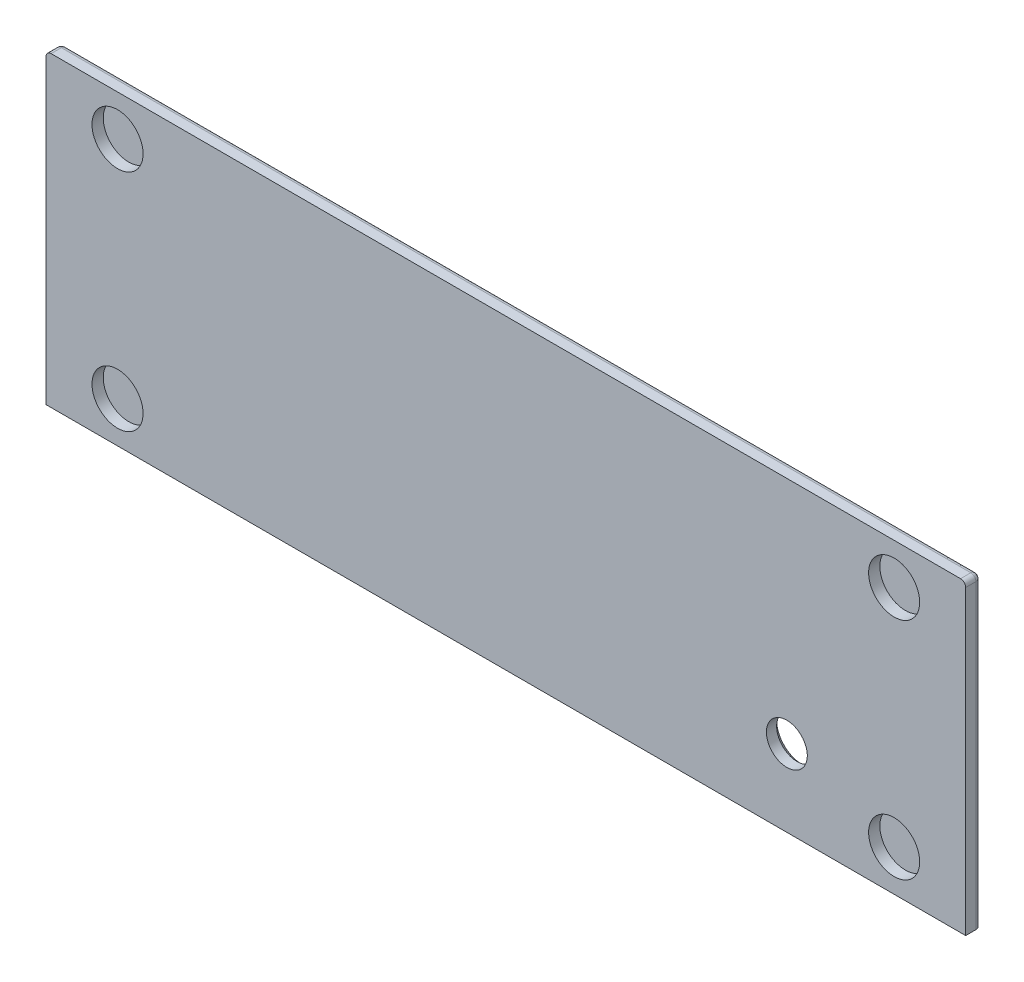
ISO-10303-21;
HEADER;
FILE_DESCRIPTION(('STEP AP214'),'2;1');
FILE_NAME('part.step','',(''),(''),'','','');
FILE_SCHEMA(('AUTOMOTIVE_DESIGN { 1 0 10303 214 1 1 1 1 }'));
ENDSEC;
DATA;
#1=APPLICATION_CONTEXT('core data for automotive mechanical design processes');
#2=APPLICATION_PROTOCOL_DEFINITION('international standard','automotive_design',2000,#1);
#3=PRODUCT_CONTEXT('',#1,'mechanical');
#4=PRODUCT('Part','Part','',(#3));
#5=PRODUCT_RELATED_PRODUCT_CATEGORY('part','',(#4));
#6=PRODUCT_DEFINITION_FORMATION('','',#4);
#7=PRODUCT_DEFINITION_CONTEXT('part definition',#1,'design');
#8=PRODUCT_DEFINITION('design','',#6,#7);
#9=PRODUCT_DEFINITION_SHAPE('','',#8);
#10=(LENGTH_UNIT() NAMED_UNIT(*) SI_UNIT(.MILLI.,.METRE.));
#11=(NAMED_UNIT(*) PLANE_ANGLE_UNIT() SI_UNIT($,.RADIAN.));
#12=(NAMED_UNIT(*) SI_UNIT($,.STERADIAN.) SOLID_ANGLE_UNIT());
#13=UNCERTAINTY_MEASURE_WITH_UNIT(LENGTH_MEASURE(1.E-05),#10,'distance_accuracy_value','');
#14=(GEOMETRIC_REPRESENTATION_CONTEXT(3) GLOBAL_UNCERTAINTY_ASSIGNED_CONTEXT((#13)) GLOBAL_UNIT_ASSIGNED_CONTEXT((#10,
#11,#12)) REPRESENTATION_CONTEXT('',''));
#15=CARTESIAN_POINT('',(0.,0.,0.));
#16=DIRECTION('',(0.,0.,1.));
#17=DIRECTION('',(1.,0.,0.));
#18=AXIS2_PLACEMENT_3D('',#15,#16,#17);
#19=CARTESIAN_POINT('',(90.,-30.,3.));
#20=DIRECTION('',(-1.,0.,0.));
#21=DIRECTION('',(0.,0.,1.));
#22=AXIS2_PLACEMENT_3D('',#19,#20,#21);
#23=PLANE('',#22);
#24=DIRECTION('',(0.,0.,-1.));
#25=VECTOR('',#24,1.);
#26=CARTESIAN_POINT('',(90.,-30.,3.));
#27=LINE('',#26,#25);
#28=CARTESIAN_POINT('',(90.,-30.,3.));
#29=VERTEX_POINT('',#28);
#30=CARTESIAN_POINT('',(90.,-30.,1.));
#31=VERTEX_POINT('',#30);
#32=EDGE_CURVE('E138',#29,#31,#27,.T.);
#33=ORIENTED_EDGE('',*,*,#32,.T.);
#34=DIRECTION('',(0.,1.,0.));
#35=VECTOR('',#34,1.);
#36=CARTESIAN_POINT('',(90.,30.,1.));
#37=LINE('',#36,#35);
#38=CARTESIAN_POINT('',(90.,29.,1.));
#39=VERTEX_POINT('',#38);
#40=EDGE_CURVE('E64',#31,#39,#37,.T.);
#41=ORIENTED_EDGE('',*,*,#40,.T.);
#42=DIRECTION('',(0.,0.,-1.));
#43=VECTOR('',#42,1.);
#44=CARTESIAN_POINT('',(90.,29.,3.));
#45=LINE('',#44,#43);
#46=CARTESIAN_POINT('',(90.,29.,3.));
#47=VERTEX_POINT('',#46);
#48=EDGE_CURVE('E187',#39,#47,#45,.F.);
#49=ORIENTED_EDGE('',*,*,#48,.T.);
#50=DIRECTION('',(0.,1.,0.));
#51=VECTOR('',#50,1.);
#52=CARTESIAN_POINT('',(90.,-30.,3.));
#53=LINE('',#52,#51);
#54=EDGE_CURVE('E151',#29,#47,#53,.T.);
#55=ORIENTED_EDGE('',*,*,#54,.F.);
#56=EDGE_LOOP('',(#33,#41,#49,#55));
#57=FACE_BOUND('',#56,.T.);
#58=ADVANCED_FACE('F47',(#57),#23,.F.);
#59=CARTESIAN_POINT('',(-90.,30.,3.));
#60=DIRECTION('',(0.,-1.,0.));
#61=DIRECTION('',(0.,0.,-1.));
#62=AXIS2_PLACEMENT_3D('',#59,#60,#61);
#63=PLANE('',#62);
#64=DIRECTION('',(-1.,0.,0.));
#65=VECTOR('',#64,1.);
#66=CARTESIAN_POINT('',(-90.,30.,1.));
#67=LINE('',#66,#65);
#68=CARTESIAN_POINT('',(89.,30.,1.));
#69=VERTEX_POINT('',#68);
#70=CARTESIAN_POINT('',(-89.,30.,1.));
#71=VERTEX_POINT('',#70);
#72=EDGE_CURVE('E162',#69,#71,#67,.T.);
#73=ORIENTED_EDGE('',*,*,#72,.T.);
#74=DIRECTION('',(0.,0.,-1.));
#75=VECTOR('',#74,1.);
#76=CARTESIAN_POINT('',(-89.,30.,3.));
#77=LINE('',#76,#75);
#78=CARTESIAN_POINT('',(-89.,30.,3.));
#79=VERTEX_POINT('',#78);
#80=EDGE_CURVE('E165',#71,#79,#77,.F.);
#81=ORIENTED_EDGE('',*,*,#80,.T.);
#82=DIRECTION('',(-1.,0.,0.));
#83=VECTOR('',#82,1.);
#84=CARTESIAN_POINT('',(-90.,30.,3.));
#85=LINE('',#84,#83);
#86=CARTESIAN_POINT('',(88.9999999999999,30.,3.));
#87=VERTEX_POINT('',#86);
#88=EDGE_CURVE('E128',#87,#79,#85,.T.);
#89=ORIENTED_EDGE('',*,*,#88,.F.);
#90=DIRECTION('',(0.,0.,-1.));
#91=VECTOR('',#90,1.);
#92=CARTESIAN_POINT('',(89.,30.,3.));
#93=LINE('',#92,#91);
#94=EDGE_CURVE('E159',#87,#69,#93,.T.);
#95=ORIENTED_EDGE('',*,*,#94,.T.);
#96=EDGE_LOOP('',(#73,#81,#89,#95));
#97=FACE_BOUND('',#96,.T.);
#98=ADVANCED_FACE('F232',(#97),#63,.F.);
#99=CARTESIAN_POINT('',(-90.,-30.,3.));
#100=DIRECTION('',(1.,0.,0.));
#101=DIRECTION('',(0.,0.,-1.));
#102=AXIS2_PLACEMENT_3D('',#99,#100,#101);
#103=PLANE('',#102);
#104=DIRECTION('',(0.,-1.,0.));
#105=VECTOR('',#104,1.);
#106=CARTESIAN_POINT('',(-90.,-30.,3.));
#107=LINE('',#106,#105);
#108=CARTESIAN_POINT('',(-90.,29.,3.));
#109=VERTEX_POINT('',#108);
#110=CARTESIAN_POINT('',(-90.,-30.,3.));
#111=VERTEX_POINT('',#110);
#112=EDGE_CURVE('E114',#109,#111,#107,.T.);
#113=ORIENTED_EDGE('',*,*,#112,.F.);
#114=DIRECTION('',(0.,0.,-1.));
#115=VECTOR('',#114,1.);
#116=CARTESIAN_POINT('',(-90.,29.,3.));
#117=LINE('',#116,#115);
#118=CARTESIAN_POINT('',(-90.,29.,1.));
#119=VERTEX_POINT('',#118);
#120=EDGE_CURVE('E156',#109,#119,#117,.T.);
#121=ORIENTED_EDGE('',*,*,#120,.T.);
#122=DIRECTION('',(0.,-1.,0.));
#123=VECTOR('',#122,1.);
#124=CARTESIAN_POINT('',(-90.,-30.,1.));
#125=LINE('',#124,#123);
#126=CARTESIAN_POINT('',(-90.,-30.,1.));
#127=VERTEX_POINT('',#126);
#128=EDGE_CURVE('E134',#119,#127,#125,.T.);
#129=ORIENTED_EDGE('',*,*,#128,.T.);
#130=DIRECTION('',(0.,0.,-1.));
#131=VECTOR('',#130,1.);
#132=CARTESIAN_POINT('',(-90.,-30.,3.));
#133=LINE('',#132,#131);
#134=EDGE_CURVE('E131',#111,#127,#133,.T.);
#135=ORIENTED_EDGE('',*,*,#134,.F.);
#136=EDGE_LOOP('',(#113,#121,#129,#135));
#137=FACE_BOUND('',#136,.T.);
#138=ADVANCED_FACE('F132',(#137),#103,.F.);
#139=CARTESIAN_POINT('',(-90.,-30.,3.));
#140=DIRECTION('',(0.,1.,0.));
#141=DIRECTION('',(0.,0.,1.));
#142=AXIS2_PLACEMENT_3D('',#139,#140,#141);
#143=PLANE('',#142);
#144=ORIENTED_EDGE('',*,*,#134,.T.);
#145=CARTESIAN_POINT('',(-89.,-30.,1.));
#146=DIRECTION('',(0.,1.,0.));
#147=DIRECTION('',(0.,0.,1.));
#148=AXIS2_PLACEMENT_3D('',#145,#146,#147);
#149=CIRCLE('',#148,1.);
#150=CARTESIAN_POINT('',(-89.,-30.,0.));
#151=VERTEX_POINT('',#150);
#152=EDGE_CURVE('E176',#127,#151,#149,.F.);
#153=ORIENTED_EDGE('',*,*,#152,.T.);
#154=DIRECTION('',(1.,0.,0.));
#155=VECTOR('',#154,1.);
#156=CARTESIAN_POINT('',(-90.,-30.,0.));
#157=LINE('',#156,#155);
#158=CARTESIAN_POINT('',(88.9999999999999,-30.,0.));
#159=VERTEX_POINT('',#158);
#160=EDGE_CURVE('E148',#151,#159,#157,.T.);
#161=ORIENTED_EDGE('',*,*,#160,.T.);
#162=CARTESIAN_POINT('',(89.,-30.,1.));
#163=DIRECTION('',(0.,1.,0.));
#164=DIRECTION('',(0.,0.,1.));
#165=AXIS2_PLACEMENT_3D('',#162,#163,#164);
#166=CIRCLE('',#165,1.);
#167=EDGE_CURVE('E173',#159,#31,#166,.F.);
#168=ORIENTED_EDGE('',*,*,#167,.T.);
#169=ORIENTED_EDGE('',*,*,#32,.F.);
#170=DIRECTION('',(1.,0.,0.));
#171=VECTOR('',#170,1.);
#172=CARTESIAN_POINT('',(-90.,-30.,3.));
#173=LINE('',#172,#171);
#174=EDGE_CURVE('E120',#111,#29,#173,.T.);
#175=ORIENTED_EDGE('',*,*,#174,.F.);
#176=EDGE_LOOP('',(#144,#153,#161,#168,#169,#175));
#177=FACE_BOUND('',#176,.T.);
#178=ADVANCED_FACE('F140',(#177),#143,.F.);
#179=CARTESIAN_POINT('',(0.,0.,3.));
#180=DIRECTION('',(0.,0.,-1.));
#181=DIRECTION('',(-1.,0.,0.));
#182=AXIS2_PLACEMENT_3D('',#179,#180,#181);
#183=PLANE('',#182);
#184=CARTESIAN_POINT('',(55.,-15.,3.));
#185=DIRECTION('',(0.,0.,-1.));
#186=DIRECTION('',(-1.,0.,0.));
#187=AXIS2_PLACEMENT_3D('',#184,#185,#186);
#188=CIRCLE('',#187,4.00000000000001);
#189=CARTESIAN_POINT('',(51.,-15.,3.));
#190=VERTEX_POINT('',#189);
#191=EDGE_CURVE('E196',#190,#190,#188,.T.);
#192=ORIENTED_EDGE('',*,*,#191,.T.);
#193=EDGE_LOOP('',(#192));
#194=FACE_BOUND('',#193,.T.);
#195=CARTESIAN_POINT('',(76.,22.,3.));
#196=DIRECTION('',(0.,0.,1.));
#197=DIRECTION('',(1.,0.,0.));
#198=AXIS2_PLACEMENT_3D('',#195,#196,#197);
#199=CIRCLE('',#198,5.);
#200=CARTESIAN_POINT('',(81.,22.,3.));
#201=VERTEX_POINT('',#200);
#202=EDGE_CURVE('E293',#201,#201,#199,.T.);
#203=ORIENTED_EDGE('',*,*,#202,.F.);
#204=EDGE_LOOP('',(#203));
#205=FACE_BOUND('',#204,.T.);
#206=CARTESIAN_POINT('',(76.,-22.,3.));
#207=DIRECTION('',(0.,0.,1.));
#208=DIRECTION('',(1.,0.,0.));
#209=AXIS2_PLACEMENT_3D('',#206,#207,#208);
#210=CIRCLE('',#209,5.);
#211=CARTESIAN_POINT('',(81.,-22.,3.));
#212=VERTEX_POINT('',#211);
#213=EDGE_CURVE('E301',#212,#212,#210,.T.);
#214=ORIENTED_EDGE('',*,*,#213,.F.);
#215=EDGE_LOOP('',(#214));
#216=FACE_BOUND('',#215,.T.);
#217=CARTESIAN_POINT('',(-76.,-22.,3.));
#218=DIRECTION('',(0.,0.,1.));
#219=DIRECTION('',(1.,0.,0.));
#220=AXIS2_PLACEMENT_3D('',#217,#218,#219);
#221=CIRCLE('',#220,5.);
#222=CARTESIAN_POINT('',(-71.,-22.,3.));
#223=VERTEX_POINT('',#222);
#224=EDGE_CURVE('E286',#223,#223,#221,.T.);
#225=ORIENTED_EDGE('',*,*,#224,.F.);
#226=EDGE_LOOP('',(#225));
#227=FACE_BOUND('',#226,.T.);
#228=CARTESIAN_POINT('',(-76.,22.,3.));
#229=DIRECTION('',(0.,0.,1.));
#230=DIRECTION('',(1.,0.,0.));
#231=AXIS2_PLACEMENT_3D('',#228,#229,#230);
#232=CIRCLE('',#231,5.);
#233=CARTESIAN_POINT('',(-71.,22.,3.));
#234=VERTEX_POINT('',#233);
#235=EDGE_CURVE('E282',#234,#234,#232,.T.);
#236=ORIENTED_EDGE('',*,*,#235,.F.);
#237=EDGE_LOOP('',(#236));
#238=FACE_BOUND('',#237,.T.);
#239=ORIENTED_EDGE('',*,*,#88,.T.);
#240=CARTESIAN_POINT('',(-89.,29.,3.));
#241=DIRECTION('',(0.,0.,-1.));
#242=DIRECTION('',(-1.,0.,0.));
#243=AXIS2_PLACEMENT_3D('',#240,#241,#242);
#244=CIRCLE('',#243,1.);
#245=EDGE_CURVE('E123',#79,#109,#244,.F.);
#246=ORIENTED_EDGE('',*,*,#245,.T.);
#247=ORIENTED_EDGE('',*,*,#112,.T.);
#248=ORIENTED_EDGE('',*,*,#174,.T.);
#249=ORIENTED_EDGE('',*,*,#54,.T.);
#250=CARTESIAN_POINT('',(89.,29.,3.));
#251=DIRECTION('',(0.,0.,-1.));
#252=DIRECTION('',(-1.,0.,0.));
#253=AXIS2_PLACEMENT_3D('',#250,#251,#252);
#254=CIRCLE('',#253,1.);
#255=EDGE_CURVE('E168',#47,#87,#254,.F.);
#256=ORIENTED_EDGE('',*,*,#255,.T.);
#257=EDGE_LOOP('',(#239,#246,#247,#248,#249,#256));
#258=FACE_BOUND('',#257,.T.);
#259=ADVANCED_FACE('F117',(#194,#205,#216,#227,#238,#258),#183,.F.);
#260=CARTESIAN_POINT('',(0.,0.,0.));
#261=DIRECTION('',(0.,0.,-1.));
#262=DIRECTION('',(-1.,0.,0.));
#263=AXIS2_PLACEMENT_3D('',#260,#261,#262);
#264=PLANE('',#263);
#265=CARTESIAN_POINT('',(55.,-15.,0.));
#266=DIRECTION('',(0.,0.,-1.));
#267=DIRECTION('',(-1.,0.,0.));
#268=AXIS2_PLACEMENT_3D('',#265,#266,#267);
#269=CIRCLE('',#268,5.);
#270=CARTESIAN_POINT('',(50.,-15.,0.));
#271=VERTEX_POINT('',#270);
#272=EDGE_CURVE('E11',#271,#271,#269,.F.);
#273=ORIENTED_EDGE('',*,*,#272,.T.);
#274=EDGE_LOOP('',(#273));
#275=FACE_BOUND('',#274,.T.);
#276=ORIENTED_EDGE('',*,*,#160,.F.);
#277=DIRECTION('',(0.,-1.,0.));
#278=VECTOR('',#277,1.);
#279=CARTESIAN_POINT('',(-89.,30.,0.));
#280=LINE('',#279,#278);
#281=CARTESIAN_POINT('',(-89.,29.,0.));
#282=VERTEX_POINT('',#281);
#283=EDGE_CURVE('E184',#151,#282,#280,.F.);
#284=ORIENTED_EDGE('',*,*,#283,.T.);
#285=DIRECTION('',(-1.,0.,0.));
#286=VECTOR('',#285,1.);
#287=CARTESIAN_POINT('',(90.,29.,0.));
#288=LINE('',#287,#286);
#289=CARTESIAN_POINT('',(89.,29.,0.));
#290=VERTEX_POINT('',#289);
#291=EDGE_CURVE('E72',#282,#290,#288,.F.);
#292=ORIENTED_EDGE('',*,*,#291,.T.);
#293=DIRECTION('',(0.,1.,0.));
#294=VECTOR('',#293,1.);
#295=CARTESIAN_POINT('',(89.,-30.,0.));
#296=LINE('',#295,#294);
#297=EDGE_CURVE('E181',#290,#159,#296,.F.);
#298=ORIENTED_EDGE('',*,*,#297,.T.);
#299=EDGE_LOOP('',(#276,#284,#292,#298));
#300=FACE_BOUND('',#299,.T.);
#301=ADVANCED_FACE('F318',(#275,#300),#264,.T.);
#302=CARTESIAN_POINT('',(-76.,22.,0.8));
#303=DIRECTION('',(0.,0.,1.));
#304=DIRECTION('',(1.,0.,0.));
#305=AXIS2_PLACEMENT_3D('',#302,#303,#304);
#306=CYLINDRICAL_SURFACE('',#305,5.);
#307=CARTESIAN_POINT('',(-76.,22.,0.8));
#308=DIRECTION('',(0.,0.,1.));
#309=DIRECTION('',(1.,0.,0.));
#310=AXIS2_PLACEMENT_3D('',#307,#308,#309);
#311=CIRCLE('',#310,5.);
#312=CARTESIAN_POINT('',(-71.,22.,0.8));
#313=VERTEX_POINT('',#312);
#314=EDGE_CURVE('E152',#313,#313,#311,.T.);
#315=ORIENTED_EDGE('',*,*,#314,.F.);
#316=EDGE_LOOP('',(#315));
#317=FACE_BOUND('',#316,.T.);
#318=ORIENTED_EDGE('',*,*,#235,.T.);
#319=EDGE_LOOP('',(#318));
#320=FACE_BOUND('',#319,.T.);
#321=ADVANCED_FACE('F328',(#317,#320),#306,.F.);
#322=CARTESIAN_POINT('',(-76.,22.,0.8));
#323=DIRECTION('',(0.,0.,1.));
#324=DIRECTION('',(1.,0.,0.));
#325=AXIS2_PLACEMENT_3D('',#322,#323,#324);
#326=PLANE('',#325);
#327=ORIENTED_EDGE('',*,*,#314,.T.);
#328=EDGE_LOOP('',(#327));
#329=FACE_BOUND('',#328,.T.);
#330=ADVANCED_FACE('F330',(#329),#326,.T.);
#331=CARTESIAN_POINT('',(-76.,-22.,0.8));
#332=DIRECTION('',(0.,0.,1.));
#333=DIRECTION('',(1.,0.,0.));
#334=AXIS2_PLACEMENT_3D('',#331,#332,#333);
#335=CYLINDRICAL_SURFACE('',#334,5.);
#336=CARTESIAN_POINT('',(-76.,-22.,0.8));
#337=DIRECTION('',(0.,0.,1.));
#338=DIRECTION('',(1.,0.,0.));
#339=AXIS2_PLACEMENT_3D('',#336,#337,#338);
#340=CIRCLE('',#339,5.);
#341=CARTESIAN_POINT('',(-71.,-22.,0.8));
#342=VERTEX_POINT('',#341);
#343=EDGE_CURVE('E305',#342,#342,#340,.T.);
#344=ORIENTED_EDGE('',*,*,#343,.F.);
#345=EDGE_LOOP('',(#344));
#346=FACE_BOUND('',#345,.T.);
#347=ORIENTED_EDGE('',*,*,#224,.T.);
#348=EDGE_LOOP('',(#347));
#349=FACE_BOUND('',#348,.T.);
#350=ADVANCED_FACE('F336',(#346,#349),#335,.F.);
#351=CARTESIAN_POINT('',(-76.,-22.,0.8));
#352=DIRECTION('',(0.,0.,1.));
#353=DIRECTION('',(1.,0.,0.));
#354=AXIS2_PLACEMENT_3D('',#351,#352,#353);
#355=PLANE('',#354);
#356=ORIENTED_EDGE('',*,*,#343,.T.);
#357=EDGE_LOOP('',(#356));
#358=FACE_BOUND('',#357,.T.);
#359=ADVANCED_FACE('F386',(#358),#355,.T.);
#360=CARTESIAN_POINT('',(76.,-22.,0.8));
#361=DIRECTION('',(0.,0.,1.));
#362=DIRECTION('',(1.,0.,0.));
#363=AXIS2_PLACEMENT_3D('',#360,#361,#362);
#364=CYLINDRICAL_SURFACE('',#363,5.);
#365=CARTESIAN_POINT('',(76.,-22.,0.8));
#366=DIRECTION('',(0.,0.,1.));
#367=DIRECTION('',(1.,0.,0.));
#368=AXIS2_PLACEMENT_3D('',#365,#366,#367);
#369=CIRCLE('',#368,5.);
#370=CARTESIAN_POINT('',(81.,-22.,0.8));
#371=VERTEX_POINT('',#370);
#372=EDGE_CURVE('E297',#371,#371,#369,.T.);
#373=ORIENTED_EDGE('',*,*,#372,.F.);
#374=EDGE_LOOP('',(#373));
#375=FACE_BOUND('',#374,.T.);
#376=ORIENTED_EDGE('',*,*,#213,.T.);
#377=EDGE_LOOP('',(#376));
#378=FACE_BOUND('',#377,.T.);
#379=ADVANCED_FACE('F396',(#375,#378),#364,.F.);
#380=CARTESIAN_POINT('',(76.,-22.,0.8));
#381=DIRECTION('',(0.,0.,1.));
#382=DIRECTION('',(1.,0.,0.));
#383=AXIS2_PLACEMENT_3D('',#380,#381,#382);
#384=PLANE('',#383);
#385=ORIENTED_EDGE('',*,*,#372,.T.);
#386=EDGE_LOOP('',(#385));
#387=FACE_BOUND('',#386,.T.);
#388=ADVANCED_FACE('F406',(#387),#384,.T.);
#389=CARTESIAN_POINT('',(76.,22.,0.8));
#390=DIRECTION('',(0.,0.,1.));
#391=DIRECTION('',(1.,0.,0.));
#392=AXIS2_PLACEMENT_3D('',#389,#390,#391);
#393=CYLINDRICAL_SURFACE('',#392,5.);
#394=CARTESIAN_POINT('',(76.,22.,0.8));
#395=DIRECTION('',(0.,0.,1.));
#396=DIRECTION('',(1.,0.,0.));
#397=AXIS2_PLACEMENT_3D('',#394,#395,#396);
#398=CIRCLE('',#397,5.);
#399=CARTESIAN_POINT('',(81.,22.,0.8));
#400=VERTEX_POINT('',#399);
#401=EDGE_CURVE('E215',#400,#400,#398,.T.);
#402=ORIENTED_EDGE('',*,*,#401,.F.);
#403=EDGE_LOOP('',(#402));
#404=FACE_BOUND('',#403,.T.);
#405=ORIENTED_EDGE('',*,*,#202,.T.);
#406=EDGE_LOOP('',(#405));
#407=FACE_BOUND('',#406,.T.);
#408=ADVANCED_FACE('F271',(#404,#407),#393,.F.);
#409=CARTESIAN_POINT('',(76.,22.,0.8));
#410=DIRECTION('',(0.,0.,1.));
#411=DIRECTION('',(1.,0.,0.));
#412=AXIS2_PLACEMENT_3D('',#409,#410,#411);
#413=PLANE('',#412);
#414=ORIENTED_EDGE('',*,*,#401,.T.);
#415=EDGE_LOOP('',(#414));
#416=FACE_BOUND('',#415,.T.);
#417=ADVANCED_FACE('F266',(#416),#413,.T.);
#418=CARTESIAN_POINT('',(89.,-30.,1.));
#419=DIRECTION('',(0.,-1.,0.));
#420=DIRECTION('',(0.,0.,-1.));
#421=AXIS2_PLACEMENT_3D('',#418,#419,#420);
#422=CYLINDRICAL_SURFACE('',#421,1.);
#423=ORIENTED_EDGE('',*,*,#167,.F.);
#424=ORIENTED_EDGE('',*,*,#297,.F.);
#425=CARTESIAN_POINT('',(89.,29.,1.));
#426=DIRECTION('',(0.,1.,0.));
#427=DIRECTION('',(0.,0.,1.));
#428=AXIS2_PLACEMENT_3D('',#425,#426,#427);
#429=CIRCLE('',#428,1.);
#430=EDGE_CURVE('E212',#39,#290,#429,.T.);
#431=ORIENTED_EDGE('',*,*,#430,.F.);
#432=ORIENTED_EDGE('',*,*,#40,.F.);
#433=EDGE_LOOP('',(#423,#424,#431,#432));
#434=FACE_BOUND('',#433,.T.);
#435=ADVANCED_FACE('F263',(#434),#422,.T.);
#436=CARTESIAN_POINT('',(89.,29.,3.));
#437=DIRECTION('',(0.,0.,-1.));
#438=DIRECTION('',(-1.,0.,0.));
#439=AXIS2_PLACEMENT_3D('',#436,#437,#438);
#440=CYLINDRICAL_SURFACE('',#439,1.);
#441=ORIENTED_EDGE('',*,*,#255,.F.);
#442=ORIENTED_EDGE('',*,*,#48,.F.);
#443=CARTESIAN_POINT('',(89.,29.,1.));
#444=DIRECTION('',(0.,0.,-1.));
#445=DIRECTION('',(-1.,0.,0.));
#446=AXIS2_PLACEMENT_3D('',#443,#444,#445);
#447=CIRCLE('',#446,1.);
#448=EDGE_CURVE('E208',#69,#39,#447,.T.);
#449=ORIENTED_EDGE('',*,*,#448,.F.);
#450=ORIENTED_EDGE('',*,*,#94,.F.);
#451=EDGE_LOOP('',(#441,#442,#449,#450));
#452=FACE_BOUND('',#451,.T.);
#453=ADVANCED_FACE('F260',(#452),#440,.T.);
#454=CARTESIAN_POINT('',(89.,29.,1.));
#455=DIRECTION('',(1.,0.,0.));
#456=DIRECTION('',(0.,0.,-1.));
#457=AXIS2_PLACEMENT_3D('',#454,#455,#456);
#458=SPHERICAL_SURFACE('',#457,1.);
#459=ORIENTED_EDGE('',*,*,#448,.T.);
#460=ORIENTED_EDGE('',*,*,#430,.T.);
#461=CARTESIAN_POINT('',(89.,29.,1.));
#462=DIRECTION('',(1.,0.,0.));
#463=DIRECTION('',(0.,0.,-1.));
#464=AXIS2_PLACEMENT_3D('',#461,#462,#463);
#465=CIRCLE('',#464,1.);
#466=EDGE_CURVE('E204',#69,#290,#465,.F.);
#467=ORIENTED_EDGE('',*,*,#466,.F.);
#468=EDGE_LOOP('',(#459,#460,#467));
#469=FACE_BOUND('',#468,.T.);
#470=ADVANCED_FACE('F256',(#469),#458,.T.);
#471=CARTESIAN_POINT('',(-89.,-30.,1.));
#472=DIRECTION('',(0.,1.,0.));
#473=DIRECTION('',(0.,0.,1.));
#474=AXIS2_PLACEMENT_3D('',#471,#472,#473);
#475=CYLINDRICAL_SURFACE('',#474,1.);
#476=ORIENTED_EDGE('',*,*,#152,.F.);
#477=ORIENTED_EDGE('',*,*,#128,.F.);
#478=CARTESIAN_POINT('',(-89.,29.,1.));
#479=DIRECTION('',(0.,1.,0.));
#480=DIRECTION('',(-1.,0.,0.));
#481=AXIS2_PLACEMENT_3D('',#478,#479,#480);
#482=CIRCLE('',#481,1.);
#483=EDGE_CURVE('E200',#282,#119,#482,.T.);
#484=ORIENTED_EDGE('',*,*,#483,.F.);
#485=ORIENTED_EDGE('',*,*,#283,.F.);
#486=EDGE_LOOP('',(#476,#477,#484,#485));
#487=FACE_BOUND('',#486,.T.);
#488=ADVANCED_FACE('F252',(#487),#475,.T.);
#489=CARTESIAN_POINT('',(-90.,29.,1.));
#490=DIRECTION('',(1.,0.,0.));
#491=DIRECTION('',(0.,0.,-1.));
#492=AXIS2_PLACEMENT_3D('',#489,#490,#491);
#493=CYLINDRICAL_SURFACE('',#492,1.);
#494=ORIENTED_EDGE('',*,*,#466,.T.);
#495=ORIENTED_EDGE('',*,*,#291,.F.);
#496=CARTESIAN_POINT('',(-89.,29.,1.));
#497=DIRECTION('',(-1.,0.,0.));
#498=DIRECTION('',(0.,0.,1.));
#499=AXIS2_PLACEMENT_3D('',#496,#497,#498);
#500=CIRCLE('',#499,1.);
#501=EDGE_CURVE('E195',#71,#282,#500,.T.);
#502=ORIENTED_EDGE('',*,*,#501,.F.);
#503=ORIENTED_EDGE('',*,*,#72,.F.);
#504=EDGE_LOOP('',(#494,#495,#502,#503));
#505=FACE_BOUND('',#504,.T.);
#506=ADVANCED_FACE('F248',(#505),#493,.T.);
#507=CARTESIAN_POINT('',(-89.,29.,1.));
#508=DIRECTION('',(0.,0.,-1.));
#509=DIRECTION('',(-1.,0.,0.));
#510=AXIS2_PLACEMENT_3D('',#507,#508,#509);
#511=SPHERICAL_SURFACE('',#510,1.);
#512=ORIENTED_EDGE('',*,*,#501,.T.);
#513=ORIENTED_EDGE('',*,*,#483,.T.);
#514=CARTESIAN_POINT('',(-89.,29.,1.));
#515=DIRECTION('',(0.,0.,-1.));
#516=DIRECTION('',(-1.,0.,0.));
#517=AXIS2_PLACEMENT_3D('',#514,#515,#516);
#518=CIRCLE('',#517,1.);
#519=EDGE_CURVE('E192',#71,#119,#518,.F.);
#520=ORIENTED_EDGE('',*,*,#519,.F.);
#521=EDGE_LOOP('',(#512,#513,#520));
#522=FACE_BOUND('',#521,.T.);
#523=ADVANCED_FACE('F244',(#522),#511,.T.);
#524=CARTESIAN_POINT('',(-89.,29.,3.));
#525=DIRECTION('',(0.,0.,-1.));
#526=DIRECTION('',(-1.,0.,0.));
#527=AXIS2_PLACEMENT_3D('',#524,#525,#526);
#528=CYLINDRICAL_SURFACE('',#527,1.);
#529=ORIENTED_EDGE('',*,*,#245,.F.);
#530=ORIENTED_EDGE('',*,*,#80,.F.);
#531=ORIENTED_EDGE('',*,*,#519,.T.);
#532=ORIENTED_EDGE('',*,*,#120,.F.);
#533=EDGE_LOOP('',(#529,#530,#531,#532));
#534=FACE_BOUND('',#533,.T.);
#535=ADVANCED_FACE('F228',(#534),#528,.T.);
#536=CARTESIAN_POINT('',(55.,-15.,10.));
#537=DIRECTION('',(0.,0.,-1.));
#538=DIRECTION('',(-1.,0.,0.));
#539=AXIS2_PLACEMENT_3D('',#536,#537,#538);
#540=CYLINDRICAL_SURFACE('',#539,4.00000000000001);
#541=CARTESIAN_POINT('',(55.,-15.,1.00000000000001));
#542=DIRECTION('',(0.,0.,-1.));
#543=DIRECTION('',(-1.,0.,0.));
#544=AXIS2_PLACEMENT_3D('',#541,#542,#543);
#545=CIRCLE('',#544,4.00000000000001);
#546=CARTESIAN_POINT('',(51.,-15.,1.00000000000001));
#547=VERTEX_POINT('',#546);
#548=EDGE_CURVE('E57',#547,#547,#545,.T.);
#549=ORIENTED_EDGE('',*,*,#548,.T.);
#550=EDGE_LOOP('',(#549));
#551=FACE_BOUND('',#550,.T.);
#552=ORIENTED_EDGE('',*,*,#191,.F.);
#553=EDGE_LOOP('',(#552));
#554=FACE_BOUND('',#553,.T.);
#555=ADVANCED_FACE('F220',(#551,#554),#540,.F.);
#556=CARTESIAN_POINT('',(55.,-15.,1.00000000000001));
#557=DIRECTION('',(0.,0.,-1.));
#558=DIRECTION('',(-1.,0.,0.));
#559=AXIS2_PLACEMENT_3D('',#556,#557,#558);
#560=CONICAL_SURFACE('',#559,4.00000000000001,0.785398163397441);
#561=ORIENTED_EDGE('',*,*,#272,.F.);
#562=EDGE_LOOP('',(#561));
#563=FACE_BOUND('',#562,.T.);
#564=ORIENTED_EDGE('',*,*,#548,.F.);
#565=EDGE_LOOP('',(#564));
#566=FACE_BOUND('',#565,.T.);
#567=ADVANCED_FACE('F50',(#563,#566),#560,.F.);
#568=CLOSED_SHELL('',(#58,#98,#138,#178,#259,#301,#321,#330,#350,#359,#379,#388,#408,#417,#435,
#453,#470,#488,#506,#523,#535,#555,#567));
#569=MANIFOLD_SOLID_BREP('B2',#568);
#570=ADVANCED_BREP_SHAPE_REPRESENTATION('',(#18,#569),#14);
#571=SHAPE_DEFINITION_REPRESENTATION(#9,#570);
ENDSEC;
END-ISO-10303-21;
